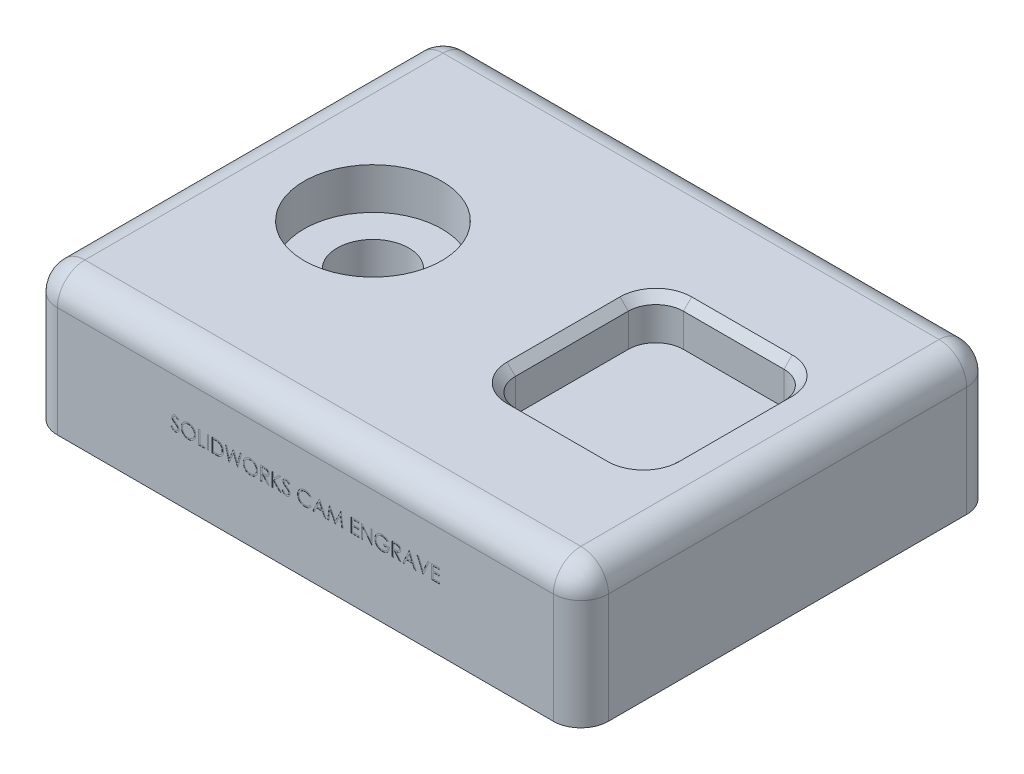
from build123d import *

# Parameters (mm, degrees)
SKETCH1_W                       = 200
SKETCH1_H                       = 150
BOSS_EXTRUDE1_DEPTH             = 50
ENGRAVE_SKETCH_W                = 0.448717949
ENGRAVE_SKETCH_H                = 5
ENGRAVE_DEPTH                   = 0.05
SKETCH4_R                       = 25
CUT_EXTRUDE3_DEPTH              = 15
CBORE_FOR_M16_SHCS1_D           = 19
CBORE_FOR_M16_SHCS1_CBORE_D     = 26
CBORE_FOR_M16_SHCS1_CBORE_DEPTH = 16
SKETCH7_W                       = 56.494229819
SKETCH7_H                       = 61.00557889
POCKET_DEPTH                    = 15
FILLET1_R                       = 10
FILLET2_R                       = 10
CHAMFER1_SIZE                   = 3


with BuildPart() as part:
    # Sketch1 → Boss-Extrude1 (new body)
    with BuildSketch(Plane(origin=(0, 0, 0), x_dir=(1, 0, 0), z_dir=(0, 1, 0))):
        Rectangle(SKETCH1_W, SKETCH1_H)
    extrude(amount=BOSS_EXTRUDE1_DEPTH)

    # Engrave_Sketch → Engrave (cut)
    # profile 1 of 20: a face of its own
    with BuildSketch(Plane.XY.offset(75)):
        with BuildLine():
            Line((-48.75, 23.464543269), (-48.327323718, 23.717948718))
            add(Edge.make_bspline(
                [(-48.327323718, 23.717948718), (-48.28801195, 23.652142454), (-48.212692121, 23.526060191), (-48.087047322, 23.355691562), (-47.956857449, 23.210888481), (-47.821158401, 23.092493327), (-47.680778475, 22.999280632), (-47.534801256, 22.933277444), (-47.383718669, 22.892111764), (-47.280898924, 22.887111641), (-47.229567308, 22.884615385)],
                knots=[0, 0, 0, 0, 1.272034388, 2.437168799, 3.508375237, 4.49857839, 5.41946034, 6.295179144, 7.148887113, 8, 8, 8, 8], degree=3))
            add(Edge.make_bspline(
                [(-47.229567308, 22.884615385), (-47.185728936, 22.885836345), (-47.09881926, 22.888256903), (-46.970873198, 22.911515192), (-46.846613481, 22.947246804), (-46.728601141, 22.998419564), (-46.618464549, 23.060331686), (-46.521883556, 23.13511194), (-46.438389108, 23.218835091), (-46.370090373, 23.312238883), (-46.317690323, 23.412691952), (-46.277415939, 23.515800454), (-46.255065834, 23.623184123), (-46.251699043, 23.695484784), (-46.25, 23.731971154)],
                knots=[0, 0, 0, 0, 1.095163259, 2.171163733, 3.241058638, 4.321873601, 5.38011039, 6.391990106, 7.366004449, 8.327778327, 9.272591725, 10.192022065, 11.087607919, 12, 12, 12, 12], degree=3))
            add(Edge.make_bspline(
                [(-46.25, 23.731971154), (-46.252106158, 23.773600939), (-46.25638767, 23.858228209), (-46.292575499, 23.983084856), (-46.349502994, 24.106645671), (-46.402021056, 24.18307605), (-46.429286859, 24.22275641)],
                knots=[0, 0, 0, 0, 0.938893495, 1.908633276, 2.914225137, 4, 4, 4, 4], degree=3))
            add(Edge.make_bspline(
                [(-46.429286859, 24.22275641), (-46.451673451, 24.25139473), (-46.4986713, 24.311517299), (-46.579467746, 24.401010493), (-46.674276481, 24.49332252), (-46.779852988, 24.591978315), (-46.900043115, 24.692389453), (-47.031082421, 24.799344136), (-47.176316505, 24.908774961), (-47.278172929, 24.98216434), (-47.330729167, 25.020032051)],
                knots=[0, 0, 0, 0, 0.722233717, 1.516239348, 2.393582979, 3.351407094, 4.387010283, 5.505090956, 6.712668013, 8, 8, 8, 8], degree=3))
            add(Edge.make_bspline(
                [(-47.330729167, 25.020032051), (-47.383334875, 25.057501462), (-47.483912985, 25.129140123), (-47.624568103, 25.235460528), (-47.750345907, 25.332666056), (-47.860687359, 25.421671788), (-47.955543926, 25.502489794), (-48.035663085, 25.574343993), (-48.09900388, 25.639177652), (-48.134226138, 25.681236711), (-48.150040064, 25.700120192)],
                knots=[0, 0, 0, 0, 1.452282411, 2.77665338, 3.964542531, 5.026858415, 5.96415736, 6.766646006, 7.446254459, 8, 8, 8, 8], degree=3))
            add(Edge.make_bspline(
                [(-48.150040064, 25.700120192), (-48.1721437, 25.729550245), (-48.215613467, 25.787428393), (-48.272993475, 25.877892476), (-48.321763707, 25.970497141), (-48.35999561, 26.065491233), (-48.392190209, 26.161541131), (-48.413844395, 26.259900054), (-48.427403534, 26.360126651), (-48.428792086, 26.427574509), (-48.429487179, 26.461338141)],
                knots=[0, 0, 0, 0, 1.068054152, 2.10047183, 3.106115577, 4.101338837, 5.06977816, 6.043150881, 7.020423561, 8, 8, 8, 8], degree=3))
            add(Edge.make_bspline(
                [(-48.429487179, 26.461338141), (-48.427622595, 26.514237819), (-48.423933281, 26.618906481), (-48.392732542, 26.771807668), (-48.343485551, 26.917788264), (-48.274492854, 27.055403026), (-48.185553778, 27.181068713), (-48.082630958, 27.296230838), (-47.96004312, 27.393043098), (-47.825539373, 27.477631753), (-47.678315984, 27.543840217), (-47.524043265, 27.593784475), (-47.362476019, 27.622083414), (-47.25304297, 27.626144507), (-47.197516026, 27.628205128)],
                knots=[0, 0, 0, 0, 1.005424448, 1.989358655, 2.955360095, 3.929531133, 4.905563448, 5.876582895, 6.856512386, 7.866279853, 8.892233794, 9.918561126, 10.94386622, 12, 12, 12, 12], degree=3))
            add(Edge.make_bspline(
                [(-47.197516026, 27.628205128), (-47.138595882, 27.626172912), (-47.021422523, 27.622131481), (-46.8490665, 27.586992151), (-46.68312262, 27.528848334), (-46.549632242, 27.462864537), (-46.445156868, 27.396962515), (-46.365481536, 27.336934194), (-46.28474232, 27.267826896), (-46.202287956, 27.189456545), (-46.119515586, 27.101104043), (-46.035196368, 27.003374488), (-45.949133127, 26.896865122), (-45.893767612, 26.820830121), (-45.865384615, 26.781850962)],
                knots=[0, 0, 0, 0, 1.286793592, 2.559021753, 3.825965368, 5.121522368, 5.803751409, 6.523245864, 7.299691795, 8.125521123, 9.008227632, 9.944561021, 10.946284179, 12, 12, 12, 12], degree=3))
            Line((-45.865384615, 26.781850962), (-46.271033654, 26.474358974))
            add(Edge.make_bspline(
                [(-46.271033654, 26.474358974), (-46.295527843, 26.505914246), (-46.342697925, 26.566682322), (-46.414311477, 26.651784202), (-46.481809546, 26.72952203), (-46.548310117, 26.797043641), (-46.610301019, 26.858046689), (-46.670468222, 26.910274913), (-46.727945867, 26.954240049), (-46.800398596, 27.001159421), (-46.891423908, 27.047668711), (-47.005687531, 27.087024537), (-47.125096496, 27.110674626), (-47.206424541, 27.113801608), (-47.247596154, 27.115384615)],
                knots=[0, 0, 0, 0, 1.181633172, 2.275549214, 3.290209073, 4.226197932, 5.078386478, 5.862611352, 6.581680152, 7.217281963, 8.414376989, 9.595101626, 10.782541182, 12, 12, 12, 12], degree=3))
            add(Edge.make_bspline(
                [(-47.247596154, 27.115384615), (-47.299248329, 27.113653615), (-47.398854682, 27.110315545), (-47.540269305, 27.073858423), (-47.667546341, 27.016455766), (-47.776907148, 26.936005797), (-47.867959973, 26.840690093), (-47.933824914, 26.731006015), (-47.973468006, 26.609888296), (-47.978305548, 26.525400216), (-47.980769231, 26.482371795)],
                knots=[0, 0, 0, 0, 1.14458467, 2.207223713, 3.21896685, 4.227309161, 5.202851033, 6.127160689, 7.046193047, 8, 8, 8, 8], degree=3))
            add(Edge.make_bspline(
                [(-47.980769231, 26.482371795), (-47.980207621, 26.455583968), (-47.979083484, 26.401964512), (-47.963405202, 26.322748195), (-47.943263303, 26.243731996), (-47.911345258, 26.165271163), (-47.867280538, 26.085993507), (-47.809416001, 26.004533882), (-47.736539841, 25.920174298), (-47.680715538, 25.865306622), (-47.651241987, 25.836338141)],
                knots=[0, 0, 0, 0, 0.858281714, 1.717966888, 2.583508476, 3.4729293, 4.427298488, 5.488583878, 6.674047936, 8, 8, 8, 8], degree=3))
            add(Edge.make_bspline(
                [(-47.651241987, 25.836338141), (-47.640297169, 25.826570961), (-47.614294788, 25.803366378), (-47.566757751, 25.765377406), (-47.503982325, 25.718516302), (-47.427607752, 25.660534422), (-47.336225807, 25.59327519), (-47.229826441, 25.517598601), (-47.109595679, 25.431047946), (-47.024278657, 25.370537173), (-46.979166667, 25.338541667)],
                knots=[0, 0, 0, 0, 0.420754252, 0.999615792, 1.744751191, 2.668019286, 3.750313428, 4.999500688, 6.413464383, 8, 8, 8, 8], degree=3))
            add(Edge.make_bspline(
                [(-46.979166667, 25.338541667), (-46.924901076, 25.29905401), (-46.819823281, 25.222591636), (-46.670312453, 25.107712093), (-46.53474987, 24.995358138), (-46.412659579, 24.886247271), (-46.302835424, 24.781207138), (-46.206495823, 24.678974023), (-46.122659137, 24.580280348), (-46.032403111, 24.453748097), (-45.940177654, 24.298346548), (-45.860975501, 24.107949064), (-45.811035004, 23.916811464), (-45.804504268, 23.788344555), (-45.801282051, 23.724959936)],
                knots=[0, 0, 0, 0, 1.163667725, 2.253281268, 3.268753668, 4.215851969, 5.092017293, 5.902905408, 6.650798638, 7.335211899, 8.59617414, 9.77448103, 10.901945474, 12, 12, 12, 12], degree=3))
            add(Edge.make_bspline(
                [(-45.801282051, 23.724959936), (-45.80222082, 23.6801337), (-45.804080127, 23.591351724), (-45.825452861, 23.460987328), (-45.856766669, 23.3343718), (-45.903962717, 23.213070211), (-45.961567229, 23.094863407), (-46.034661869, 22.982852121), (-46.119387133, 22.874557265), (-46.216578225, 22.772866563), (-46.322929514, 22.679514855), (-46.435334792, 22.596473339), (-46.55397804, 22.527232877), (-46.678215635, 22.470731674), (-46.808076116, 22.426540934), (-46.943515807, 22.39452255), (-47.084757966, 22.374871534), (-47.180758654, 22.372831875), (-47.229567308, 22.371794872)],
                knots=[0, 0, 0, 0, 0.983748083, 1.948392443, 2.894712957, 3.844097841, 4.80183111, 5.778335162, 6.776009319, 7.81870978, 8.863265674, 9.881300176, 10.883814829, 11.87499822, 12.874611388, 13.892143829, 14.928324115, 16, 16, 16, 16], degree=3))
            add(Edge.make_bspline(
                [(-47.229567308, 22.371794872), (-47.267332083, 22.372525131), (-47.342386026, 22.373976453), (-47.453399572, 22.386806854), (-47.562170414, 22.404959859), (-47.667333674, 22.433779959), (-47.770244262, 22.468747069), (-47.870454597, 22.51180183), (-47.968013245, 22.563397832), (-48.063466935, 22.622390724), (-48.156572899, 22.691044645), (-48.246457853, 22.771006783), (-48.336070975, 22.86007179), (-48.422767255, 22.960658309), (-48.508300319, 23.071141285), (-48.590983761, 23.192554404), (-48.672529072, 23.324236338), (-48.723694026, 23.416900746), (-48.75, 23.464543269)],
                knots=[0, 0, 0, 0, 0.915332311, 1.819136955, 2.706846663, 3.586547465, 4.459518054, 5.340707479, 6.227863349, 7.133153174, 8.059268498, 9.028702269, 10.047606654, 11.120612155, 12.245963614, 13.433783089, 14.680604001, 16, 16, 16, 16], degree=3))
        make_face()
    # profile 2 of 20: a face of its own
    with BuildSketch(Plane.XY.offset(75)):
        with BuildLine():
            add(Edge.make_bspline(
                [(-42.435897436, 27.628205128), (-42.343314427, 27.625860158), (-42.16147376, 27.621254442), (-41.894223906, 27.58599858), (-41.639088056, 27.525005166), (-41.393987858, 27.443772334), (-41.161855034, 27.335408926), (-40.940942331, 27.204430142), (-40.731775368, 27.049463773), (-40.537173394, 26.871707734), (-40.359092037, 26.6783028), (-40.202197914, 26.471905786), (-40.070708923, 26.25376464), (-39.962729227, 26.024534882), (-39.878016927, 25.784734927), (-39.81956115, 25.533086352), (-39.782220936, 25.271219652), (-39.777855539, 25.092609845), (-39.775641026, 25.002003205)],
                knots=[0, 0, 0, 0, 1.065120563, 2.091984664, 3.0946048, 4.079830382, 5.057816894, 6.036188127, 7.030412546, 8.04752943, 9.064399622, 10.05169764, 11.02544977, 11.989514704, 12.962713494, 13.945757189, 14.957906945, 16, 16, 16, 16], degree=3))
            add(Edge.make_bspline(
                [(-39.775641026, 25.002003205), (-39.777855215, 24.912063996), (-39.782219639, 24.734783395), (-39.819603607, 24.474578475), (-39.878233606, 24.224448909), (-39.961942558, 23.984812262), (-40.069407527, 23.755415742), (-40.201772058, 23.536862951), (-40.357688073, 23.329082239), (-40.535126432, 23.13434986), (-40.728556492, 22.955782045), (-40.936028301, 22.800183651), (-41.152875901, 22.666292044), (-41.38188977, 22.559458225), (-41.62003268, 22.474069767), (-41.869435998, 22.415851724), (-42.128931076, 22.378298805), (-42.305889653, 22.373986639), (-42.395833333, 22.371794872)],
                knots=[0, 0, 0, 0, 1.043624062, 2.057103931, 3.04512605, 4.022047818, 4.998200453, 5.980619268, 6.982898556, 8.009068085, 9.034988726, 10.034168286, 11.015286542, 11.987931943, 12.962482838, 13.94673481, 14.956375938, 16, 16, 16, 16], degree=3))
            add(Edge.make_bspline(
                [(-42.395833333, 22.371794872), (-42.486439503, 22.374008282), (-42.665048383, 22.378371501), (-42.927244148, 22.415773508), (-43.179069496, 22.474261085), (-43.419804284, 22.557845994), (-43.649582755, 22.665870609), (-43.868854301, 22.797591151), (-44.076738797, 22.953887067), (-44.271512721, 23.131267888), (-44.449725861, 23.324370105), (-44.605096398, 23.531276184), (-44.73684656, 23.747926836), (-44.844508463, 23.974923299), (-44.929743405, 24.211168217), (-44.987893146, 24.458237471), (-45.025515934, 24.714722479), (-45.029851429, 24.889355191), (-45.032051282, 24.977964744)],
                knots=[0, 0, 0, 0, 1.053102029, 2.075944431, 3.073151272, 4.055350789, 5.033113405, 6.020478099, 7.024410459, 8.052272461, 9.079885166, 10.07527673, 11.055994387, 12.023226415, 12.992069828, 13.970394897, 14.97016774, 16, 16, 16, 16], degree=3))
            add(Edge.make_bspline(
                [(-45.032051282, 24.977964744), (-45.031287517, 25.037439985), (-45.029769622, 25.155640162), (-45.011495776, 25.331163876), (-44.98497906, 25.503864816), (-44.946976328, 25.673251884), (-44.897273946, 25.838910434), (-44.838628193, 26.001982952), (-44.766999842, 26.160816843), (-44.686027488, 26.316164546), (-44.595653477, 26.465604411), (-44.495830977, 26.606860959), (-44.390066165, 26.741119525), (-44.27411846, 26.864900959), (-44.151809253, 26.981806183), (-44.021154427, 27.090038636), (-43.88295122, 27.19057428), (-43.736604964, 27.281174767), (-43.585721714, 27.363116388), (-43.43018346, 27.433433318), (-43.272102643, 27.493784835), (-43.110738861, 27.542700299), (-42.946520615, 27.581317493), (-42.779089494, 27.607613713), (-42.608578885, 27.625934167), (-42.493705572, 27.627444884), (-42.435897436, 27.628205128)],
                knots=[0, 0, 0, 0, 1.037015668, 2.060948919, 3.074880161, 4.083647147, 5.086022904, 6.090072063, 7.104153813, 8.122640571, 9.144368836, 10.147691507, 11.138137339, 12.123020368, 13.103399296, 14.087645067, 15.080126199, 16.082011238, 17.087798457, 18.072939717, 19.057185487, 20.037253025, 21.01195951, 21.997135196, 22.992090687, 24, 24, 24, 24], degree=3))
        make_face()
        with BuildLine():
            add(Edge.make_bspline(
                [(-42.413862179, 27.115384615), (-42.461311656, 27.114806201), (-42.555756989, 27.113654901), (-42.696163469, 27.098489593), (-42.834723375, 27.076875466), (-42.971465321, 27.046044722), (-43.105817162, 27.004038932), (-43.239031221, 26.955694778), (-43.369892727, 26.896807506), (-43.497969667, 26.830275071), (-43.62213406, 26.756633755), (-43.739295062, 26.675245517), (-43.849755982, 26.588019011), (-43.953246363, 26.494750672), (-44.049462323, 26.394965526), (-44.140297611, 26.290176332), (-44.222111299, 26.177387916), (-44.297090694, 26.059658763), (-44.364187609, 25.937142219), (-44.423852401, 25.81112813), (-44.472658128, 25.680588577), (-44.512461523, 25.546939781), (-44.545461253, 25.41039341), (-44.566366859, 25.269913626), (-44.581698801, 25.126206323), (-44.582784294, 25.029089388), (-44.583333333, 24.979967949)],
                knots=[0, 0, 0, 0, 1.008559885, 2.007477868, 2.99961109, 3.989939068, 4.984837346, 5.991145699, 7.001802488, 8.033829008, 9.059044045, 10.069351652, 11.065060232, 12.050310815, 13.029377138, 14.011219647, 14.996725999, 15.989392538, 16.977580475, 17.965360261, 18.951710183, 19.937753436, 20.929683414, 21.935841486, 22.955955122, 24, 24, 24, 24], degree=3))
            add(Edge.make_bspline(
                [(-44.583333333, 24.979967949), (-44.581512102, 24.907736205), (-44.577929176, 24.765634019), (-44.546561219, 24.557393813), (-44.498244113, 24.35726769), (-44.427019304, 24.166350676), (-44.337946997, 23.983001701), (-44.227908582, 23.808847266), (-44.09753846, 23.643840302), (-43.949447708, 23.489132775), (-43.787558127, 23.347924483), (-43.615654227, 23.223976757), (-43.435577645, 23.119104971), (-43.246858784, 23.033669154), (-43.050505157, 22.965969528), (-42.845251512, 22.919571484), (-42.632465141, 22.889035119), (-42.487421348, 22.886102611), (-42.413862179, 22.884615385)],
                knots=[0, 0, 0, 0, 1.032063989, 2.030389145, 3.003944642, 3.970395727, 4.937377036, 5.913328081, 6.909231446, 7.93887556, 8.970685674, 9.976071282, 10.964166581, 11.944589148, 12.933237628, 13.927779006, 14.949070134, 16, 16, 16, 16], degree=3))
            add(Edge.make_bspline(
                [(-42.413862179, 22.884615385), (-42.364420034, 22.885294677), (-42.266361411, 22.886641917), (-42.120510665, 22.900211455), (-41.977287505, 22.921971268), (-41.83689282, 22.953300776), (-41.699485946, 22.992511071), (-41.56449337, 23.03909354), (-41.433352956, 23.097209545), (-41.30441033, 23.161420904), (-41.180987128, 23.234621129), (-41.063164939, 23.313247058), (-40.953913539, 23.400345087), (-40.85050058, 23.492227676), (-40.753889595, 23.590747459), (-40.664733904, 23.695776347), (-40.583333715, 23.807977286), (-40.508382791, 23.925527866), (-40.441520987, 24.048379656), (-40.383265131, 24.174850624), (-40.333842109, 24.304629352), (-40.293944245, 24.437903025), (-40.2626793, 24.574418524), (-40.241136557, 24.714358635), (-40.226067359, 24.85744341), (-40.224931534, 24.954220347), (-40.224358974, 25.003004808)],
                knots=[0, 0, 0, 0, 1.047197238, 2.076906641, 3.100256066, 4.114471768, 5.12198147, 6.126382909, 7.136867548, 8.15857795, 9.17633901, 10.174870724, 11.156907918, 12.133735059, 13.104061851, 14.077631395, 15.04955518, 16.038496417, 17.029181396, 18.010275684, 18.986308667, 19.968651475, 20.955262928, 21.950658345, 22.966943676, 24, 24, 24, 24], degree=3))
            add(Edge.make_bspline(
                [(-40.224358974, 25.003004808), (-40.224931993, 25.051455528), (-40.226068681, 25.147566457), (-40.241129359, 25.28965334), (-40.262702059, 25.4285865), (-40.293791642, 25.563820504), (-40.33386329, 25.695389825), (-40.383273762, 25.823170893), (-40.441538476, 25.947639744), (-40.508407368, 26.068488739), (-40.58357283, 26.184452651), (-40.665707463, 26.29531324), (-40.756229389, 26.398988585), (-40.852552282, 26.498038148), (-40.957082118, 26.590349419), (-41.069345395, 26.675953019), (-41.187979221, 26.75691484), (-41.313589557, 26.829951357), (-41.443223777, 26.897400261), (-41.576243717, 26.955187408), (-41.71114243, 27.004290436), (-41.847576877, 27.046171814), (-41.986695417, 27.076754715), (-42.12755803, 27.098509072), (-42.269969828, 27.113649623), (-42.365745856, 27.114804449), (-42.413862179, 27.115384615)],
                knots=[0, 0, 0, 0, 1.02996197, 2.043119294, 3.035359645, 4.018872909, 4.991431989, 5.957985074, 6.929999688, 7.912076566, 8.892894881, 9.867085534, 10.843653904, 11.817741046, 12.803660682, 13.806313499, 14.818574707, 15.856120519, 16.894564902, 17.924820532, 18.937903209, 19.946497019, 20.957711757, 21.963978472, 22.977135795, 24, 24, 24, 24], degree=3))
        make_face(mode=Mode.SUBTRACT)
    # profile 3 of 20: a face of its own
    with BuildSketch(Plane.XY.offset(75)):
        Polygon((-38.75, 27.5), (-38.301282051, 27.5), (-38.301282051, 23.012820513), (-36.378205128, 23.012820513), (-36.378205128, 22.5), (-38.75, 22.5), align=None)
    # profile 4 of 20: a face of its own
    with BuildSketch(Plane.XY.offset(75)):
        with Locations((-35.32051282, 25)):
            Rectangle(ENGRAVE_SKETCH_W, ENGRAVE_SKETCH_H)
    # profile 5 of 20: a face of its own
    with BuildSketch(Plane.XY.offset(75)):
        with BuildLine():
            Line((-33.814102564, 22.5), (-33.814102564, 27.5))
            Line((-33.814102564, 27.5), (-32.804487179, 27.5))
            add(Edge.make_bspline(
                [(-32.804487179, 27.5), (-32.716674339, 27.499367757), (-32.547020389, 27.498146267), (-32.30185975, 27.490401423), (-32.075025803, 27.476700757), (-31.867264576, 27.456744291), (-31.678005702, 27.432239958), (-31.507779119, 27.401525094), (-31.355704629, 27.365256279), (-31.262176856, 27.334334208), (-31.217948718, 27.319711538)],
                knots=[0, 0, 0, 0, 1.314313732, 2.53924729, 3.670748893, 4.714932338, 5.66265055, 6.526160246, 7.303039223, 8, 8, 8, 8], degree=3))
            add(Edge.make_bspline(
                [(-31.217948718, 27.319711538), (-31.16009909, 27.297667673), (-31.045711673, 27.254079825), (-30.882844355, 27.171856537), (-30.729522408, 27.078694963), (-30.584923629, 26.974472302), (-30.45235102, 26.856237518), (-30.326625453, 26.72901311), (-30.212890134, 26.588172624), (-30.108735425, 26.436636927), (-30.01482734, 26.276191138), (-29.933199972, 26.107140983), (-29.865408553, 25.930344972), (-29.809132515, 25.74629476), (-29.764780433, 25.554585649), (-29.73452053, 25.354994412), (-29.714561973, 25.148309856), (-29.712556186, 25.008060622), (-29.711538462, 24.936899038)],
                knots=[0, 0, 0, 0, 0.984719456, 1.947108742, 2.898477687, 3.838006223, 4.779231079, 5.722358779, 6.681677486, 7.655904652, 8.64651281, 9.637519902, 10.640069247, 11.656948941, 12.698408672, 13.768548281, 14.867775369, 16, 16, 16, 16], degree=3))
            add(Edge.make_bspline(
                [(-29.711538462, 24.936899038), (-29.712436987, 24.875097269), (-29.714207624, 24.753310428), (-29.730106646, 24.573823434), (-29.753215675, 24.399661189), (-29.788993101, 24.231653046), (-29.832425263, 24.068327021), (-29.888088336, 23.911423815), (-29.95185333, 23.759504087), (-30.0262103, 23.614621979), (-30.10784085, 23.477360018), (-30.19544334, 23.347966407), (-30.288924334, 23.228287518), (-30.389175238, 23.11796093), (-30.494900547, 23.01715296), (-30.606792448, 22.92502151), (-30.725139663, 22.843369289), (-30.849412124, 22.768987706), (-30.983235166, 22.704101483), (-31.129143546, 22.649201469), (-31.287759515, 22.603706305), (-31.458693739, 22.565747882), (-31.642241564, 22.53563745), (-31.838582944, 22.515456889), (-32.047416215, 22.501809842), (-32.190815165, 22.500614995), (-32.264623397, 22.5)],
                knots=[0, 0, 0, 0, 1.105936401, 2.179363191, 3.223086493, 4.248585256, 5.251745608, 6.245858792, 7.225916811, 8.198733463, 9.158002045, 10.082870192, 10.993790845, 11.873723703, 12.748670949, 13.606408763, 14.465103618, 15.319838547, 16.196477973, 17.123216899, 18.106603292, 19.147568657, 20.255746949, 21.433717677, 22.679120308, 24, 24, 24, 24], degree=3))
            Line((-32.264623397, 22.5), (-33.814102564, 22.5))
        make_face()
        with BuildLine():
            Line((-33.365384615, 23.012820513), (-32.791466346, 23.012820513))
            add(Edge.make_bspline(
                [(-32.791466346, 23.012820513), (-32.708997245, 23.013174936), (-32.550378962, 23.013856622), (-32.322296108, 23.019838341), (-32.113896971, 23.029612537), (-31.925151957, 23.04329122), (-31.756167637, 23.061389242), (-31.606590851, 23.081567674), (-31.476911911, 23.10670689), (-31.398441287, 23.129493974), (-31.362179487, 23.140024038)],
                knots=[0, 0, 0, 0, 1.375205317, 2.645023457, 3.804390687, 4.853969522, 5.800190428, 6.637939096, 7.370582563, 8, 8, 8, 8], degree=3))
            add(Edge.make_bspline(
                [(-31.362179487, 23.140024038), (-31.31653897, 23.156097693), (-31.226348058, 23.187861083), (-31.096517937, 23.245800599), (-30.975436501, 23.314432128), (-30.860993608, 23.39072109), (-30.754812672, 23.477358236), (-30.655635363, 23.572459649), (-30.563661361, 23.676509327), (-30.479840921, 23.78937813), (-30.404829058, 23.910363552), (-30.339870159, 24.038276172), (-30.282939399, 24.171714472), (-30.238255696, 24.312727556), (-30.203233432, 24.460054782), (-30.178426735, 24.613706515), (-30.162977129, 24.773654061), (-30.16117506, 24.88244281), (-30.16025641, 24.937900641)],
                knots=[0, 0, 0, 0, 0.998632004, 1.973411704, 2.929992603, 3.868527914, 4.809262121, 5.754881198, 6.702106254, 7.672490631, 8.653608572, 9.636854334, 10.631411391, 11.644891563, 12.686317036, 13.754757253, 14.855430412, 16, 16, 16, 16], degree=3))
            add(Edge.make_bspline(
                [(-30.16025641, 24.937900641), (-30.160989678, 24.996377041), (-30.162430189, 25.111254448), (-30.180536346, 25.279812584), (-30.206995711, 25.441927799), (-30.24525812, 25.597610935), (-30.294016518, 25.747165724), (-30.354866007, 25.889765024), (-30.424389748, 26.026914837), (-30.507108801, 26.155449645), (-30.597702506, 26.27701123), (-30.698242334, 26.388375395), (-30.80713096, 26.489795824), (-30.923180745, 26.582851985), (-31.049662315, 26.663800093), (-31.183596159, 26.736209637), (-31.326947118, 26.797660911), (-31.426679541, 26.830345), (-31.477363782, 26.846955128)],
                knots=[0, 0, 0, 0, 1.122418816, 2.205001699, 3.251619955, 4.274784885, 5.280384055, 6.268708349, 7.249350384, 8.229342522, 9.199999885, 10.157847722, 11.105861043, 12.055065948, 13.010012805, 13.98527497, 14.976112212, 16, 16, 16, 16], degree=3))
            add(Edge.make_bspline(
                [(-31.477363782, 26.846955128), (-31.519293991, 26.858550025), (-31.60844912, 26.883203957), (-31.753934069, 26.910097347), (-31.917669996, 26.93381806), (-32.100383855, 26.953900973), (-32.301867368, 26.968311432), (-32.522275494, 26.979127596), (-32.7617035, 26.986422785), (-32.927678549, 26.986920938), (-33.013822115, 26.987179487)],
                knots=[0, 0, 0, 0, 0.674548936, 1.434276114, 2.292660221, 3.240891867, 4.284742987, 5.42552168, 6.663806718, 8, 8, 8, 8], degree=3))
            Line((-33.013822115, 26.987179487), (-33.365384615, 26.987179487))
            Line((-33.365384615, 26.987179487), (-33.365384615, 23.012820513))
        make_face(mode=Mode.SUBTRACT)
    # profile 6 of 20: a face of its own
    with BuildSketch(Plane.XY.offset(75)):
        Polygon((-29.006410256, 27.5), (-28.542668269, 27.5), (-27.564102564, 23.833133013), (-26.108774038, 27.5), (-26.043669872, 27.5), (-24.615384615, 23.858173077), (-23.631810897, 27.5), (-23.173076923, 27.5), (-24.521233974, 22.5), (-24.585336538, 22.5), (-26.08974359, 26.32411859), (-27.612179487, 22.5), (-27.676282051, 22.5), align=None)
    # profile 7 of 20: a face of its own
    with BuildSketch(Plane.XY.offset(75)):
        with BuildLine():
            add(Edge.make_bspline(
                [(-19.935897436, 27.628205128), (-19.843314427, 27.625860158), (-19.66147376, 27.621254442), (-19.394223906, 27.58599858), (-19.139088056, 27.525005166), (-18.893987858, 27.443772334), (-18.661855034, 27.335408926), (-18.440942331, 27.204430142), (-18.231775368, 27.049463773), (-18.037173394, 26.871707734), (-17.859092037, 26.6783028), (-17.702197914, 26.471905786), (-17.570708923, 26.25376464), (-17.462729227, 26.024534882), (-17.378016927, 25.784734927), (-17.31956115, 25.533086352), (-17.282220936, 25.271219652), (-17.277855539, 25.092609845), (-17.275641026, 25.002003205)],
                knots=[0, 0, 0, 0, 1.065120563, 2.091984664, 3.0946048, 4.079830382, 5.057816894, 6.036188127, 7.030412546, 8.04752943, 9.064399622, 10.05169764, 11.02544977, 11.989514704, 12.962713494, 13.945757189, 14.957906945, 16, 16, 16, 16], degree=3))
            add(Edge.make_bspline(
                [(-17.275641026, 25.002003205), (-17.277855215, 24.912063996), (-17.282219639, 24.734783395), (-17.319603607, 24.474578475), (-17.378233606, 24.224448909), (-17.461942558, 23.984812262), (-17.569407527, 23.755415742), (-17.701772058, 23.536862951), (-17.857688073, 23.329082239), (-18.035126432, 23.13434986), (-18.228556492, 22.955782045), (-18.436028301, 22.800183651), (-18.652875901, 22.666292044), (-18.88188977, 22.559458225), (-19.12003268, 22.474069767), (-19.369435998, 22.415851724), (-19.628931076, 22.378298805), (-19.805889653, 22.373986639), (-19.895833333, 22.371794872)],
                knots=[0, 0, 0, 0, 1.043624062, 2.057103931, 3.04512605, 4.022047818, 4.998200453, 5.980619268, 6.982898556, 8.009068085, 9.034988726, 10.034168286, 11.015286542, 11.987931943, 12.962482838, 13.94673481, 14.956375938, 16, 16, 16, 16], degree=3))
            add(Edge.make_bspline(
                [(-19.895833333, 22.371794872), (-19.986439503, 22.374008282), (-20.165048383, 22.378371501), (-20.427244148, 22.415773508), (-20.679069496, 22.474261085), (-20.919804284, 22.557845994), (-21.149582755, 22.665870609), (-21.368854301, 22.797591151), (-21.576738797, 22.953887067), (-21.771512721, 23.131267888), (-21.949725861, 23.324370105), (-22.105096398, 23.531276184), (-22.23684656, 23.747926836), (-22.344508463, 23.974923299), (-22.429743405, 24.211168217), (-22.487893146, 24.458237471), (-22.525515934, 24.714722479), (-22.529851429, 24.889355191), (-22.532051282, 24.977964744)],
                knots=[0, 0, 0, 0, 1.053102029, 2.075944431, 3.073151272, 4.055350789, 5.033113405, 6.020478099, 7.024410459, 8.052272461, 9.079885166, 10.07527673, 11.055994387, 12.023226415, 12.992069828, 13.970394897, 14.97016774, 16, 16, 16, 16], degree=3))
            add(Edge.make_bspline(
                [(-22.532051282, 24.977964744), (-22.531287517, 25.037439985), (-22.529769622, 25.155640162), (-22.511495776, 25.331163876), (-22.48497906, 25.503864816), (-22.446976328, 25.673251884), (-22.397273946, 25.838910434), (-22.338628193, 26.001982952), (-22.266999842, 26.160816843), (-22.186027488, 26.316164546), (-22.095653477, 26.465604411), (-21.995830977, 26.606860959), (-21.890066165, 26.741119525), (-21.77411846, 26.864900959), (-21.651809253, 26.981806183), (-21.521154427, 27.090038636), (-21.38295122, 27.19057428), (-21.236604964, 27.281174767), (-21.085721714, 27.363116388), (-20.93018346, 27.433433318), (-20.772102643, 27.493784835), (-20.610738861, 27.542700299), (-20.446520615, 27.581317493), (-20.279089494, 27.607613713), (-20.108578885, 27.625934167), (-19.993705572, 27.627444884), (-19.935897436, 27.628205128)],
                knots=[0, 0, 0, 0, 1.037015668, 2.060948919, 3.074880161, 4.083647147, 5.086022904, 6.090072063, 7.104153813, 8.122640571, 9.144368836, 10.147691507, 11.138137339, 12.123020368, 13.103399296, 14.087645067, 15.080126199, 16.082011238, 17.087798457, 18.072939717, 19.057185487, 20.037253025, 21.01195951, 21.997135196, 22.992090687, 24, 24, 24, 24], degree=3))
        make_face()
        with BuildLine():
            add(Edge.make_bspline(
                [(-19.913862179, 27.115384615), (-19.961311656, 27.114806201), (-20.055756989, 27.113654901), (-20.196163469, 27.098489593), (-20.334723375, 27.076875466), (-20.471465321, 27.046044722), (-20.605817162, 27.004038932), (-20.739031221, 26.955694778), (-20.869892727, 26.896807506), (-20.997969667, 26.830275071), (-21.12213406, 26.756633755), (-21.239295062, 26.675245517), (-21.349755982, 26.588019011), (-21.453246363, 26.494750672), (-21.549462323, 26.394965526), (-21.640297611, 26.290176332), (-21.722111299, 26.177387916), (-21.797090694, 26.059658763), (-21.864187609, 25.937142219), (-21.923852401, 25.81112813), (-21.972658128, 25.680588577), (-22.012461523, 25.546939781), (-22.045461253, 25.41039341), (-22.066366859, 25.269913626), (-22.081698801, 25.126206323), (-22.082784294, 25.029089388), (-22.083333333, 24.979967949)],
                knots=[0, 0, 0, 0, 1.008559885, 2.007477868, 2.99961109, 3.989939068, 4.984837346, 5.991145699, 7.001802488, 8.033829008, 9.059044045, 10.069351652, 11.065060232, 12.050310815, 13.029377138, 14.011219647, 14.996725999, 15.989392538, 16.977580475, 17.965360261, 18.951710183, 19.937753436, 20.929683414, 21.935841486, 22.955955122, 24, 24, 24, 24], degree=3))
            add(Edge.make_bspline(
                [(-22.083333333, 24.979967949), (-22.081512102, 24.907736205), (-22.077929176, 24.765634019), (-22.046561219, 24.557393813), (-21.998244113, 24.35726769), (-21.927019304, 24.166350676), (-21.837946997, 23.983001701), (-21.727908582, 23.808847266), (-21.59753846, 23.643840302), (-21.449447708, 23.489132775), (-21.287558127, 23.347924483), (-21.115654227, 23.223976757), (-20.935577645, 23.119104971), (-20.746858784, 23.033669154), (-20.550505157, 22.965969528), (-20.345251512, 22.919571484), (-20.132465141, 22.889035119), (-19.987421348, 22.886102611), (-19.913862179, 22.884615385)],
                knots=[0, 0, 0, 0, 1.032063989, 2.030389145, 3.003944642, 3.970395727, 4.937377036, 5.913328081, 6.909231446, 7.93887556, 8.970685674, 9.976071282, 10.964166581, 11.944589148, 12.933237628, 13.927779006, 14.949070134, 16, 16, 16, 16], degree=3))
            add(Edge.make_bspline(
                [(-19.913862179, 22.884615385), (-19.864420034, 22.885294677), (-19.766361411, 22.886641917), (-19.620510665, 22.900211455), (-19.477287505, 22.921971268), (-19.33689282, 22.953300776), (-19.199485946, 22.992511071), (-19.06449337, 23.03909354), (-18.933352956, 23.097209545), (-18.80441033, 23.161420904), (-18.680987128, 23.234621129), (-18.563164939, 23.313247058), (-18.453913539, 23.400345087), (-18.35050058, 23.492227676), (-18.253889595, 23.590747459), (-18.164733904, 23.695776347), (-18.083333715, 23.807977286), (-18.008382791, 23.925527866), (-17.941520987, 24.048379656), (-17.883265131, 24.174850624), (-17.833842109, 24.304629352), (-17.793944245, 24.437903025), (-17.7626793, 24.574418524), (-17.741136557, 24.714358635), (-17.726067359, 24.85744341), (-17.724931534, 24.954220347), (-17.724358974, 25.003004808)],
                knots=[0, 0, 0, 0, 1.047197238, 2.076906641, 3.100256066, 4.114471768, 5.12198147, 6.126382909, 7.136867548, 8.15857795, 9.17633901, 10.174870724, 11.156907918, 12.133735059, 13.104061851, 14.077631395, 15.04955518, 16.038496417, 17.029181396, 18.010275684, 18.986308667, 19.968651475, 20.955262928, 21.950658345, 22.966943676, 24, 24, 24, 24], degree=3))
            add(Edge.make_bspline(
                [(-17.724358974, 25.003004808), (-17.724931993, 25.051455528), (-17.726068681, 25.147566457), (-17.741129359, 25.28965334), (-17.762702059, 25.4285865), (-17.793791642, 25.563820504), (-17.83386329, 25.695389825), (-17.883273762, 25.823170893), (-17.941538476, 25.947639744), (-18.008407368, 26.068488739), (-18.08357283, 26.184452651), (-18.165707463, 26.29531324), (-18.256229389, 26.398988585), (-18.352552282, 26.498038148), (-18.457082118, 26.590349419), (-18.569345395, 26.675953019), (-18.687979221, 26.75691484), (-18.813589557, 26.829951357), (-18.943223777, 26.897400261), (-19.076243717, 26.955187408), (-19.21114243, 27.004290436), (-19.347576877, 27.046171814), (-19.486695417, 27.076754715), (-19.62755803, 27.098509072), (-19.769969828, 27.113649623), (-19.865745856, 27.114804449), (-19.913862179, 27.115384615)],
                knots=[0, 0, 0, 0, 1.02996197, 2.043119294, 3.035359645, 4.018872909, 4.991431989, 5.957985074, 6.929999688, 7.912076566, 8.892894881, 9.867085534, 10.843653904, 11.817741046, 12.803660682, 13.806313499, 14.818574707, 15.856120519, 16.894564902, 17.924820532, 18.937903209, 19.946497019, 20.957711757, 21.963978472, 22.977135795, 24, 24, 24, 24], degree=3))
        make_face(mode=Mode.SUBTRACT)
    # profile 8 of 20: a face of its own
    with BuildSketch(Plane.XY.offset(75)):
        with BuildLine():
            Line((-16.25, 27.5), (-15.249399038, 27.5))
            add(Edge.make_bspline(
                [(-15.249399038, 27.5), (-15.182625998, 27.499777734), (-15.054414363, 27.49935096), (-14.870738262, 27.496971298), (-14.703842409, 27.49015079), (-14.553814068, 27.484281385), (-14.420655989, 27.473578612), (-14.303959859, 27.463349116), (-14.204263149, 27.449958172), (-14.143911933, 27.437521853), (-14.116586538, 27.431891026)],
                knots=[0, 0, 0, 0, 1.410062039, 2.707475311, 3.878576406, 4.937260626, 5.877586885, 6.699081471, 7.410979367, 8, 8, 8, 8], degree=3))
            add(Edge.make_bspline(
                [(-14.116586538, 27.431891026), (-14.080005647, 27.422852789), (-14.007624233, 27.404969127), (-13.903409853, 27.367169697), (-13.804103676, 27.323427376), (-13.710118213, 27.272050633), (-13.621924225, 27.212658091), (-13.538612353, 27.146275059), (-13.459804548, 27.073264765), (-13.388687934, 26.99178642), (-13.321632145, 26.906305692), (-13.265076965, 26.813871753), (-13.216324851, 26.717212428), (-13.177509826, 26.615344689), (-13.146255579, 26.509256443), (-13.124218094, 26.397986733), (-13.111002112, 26.282042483), (-13.109656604, 26.202959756), (-13.108974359, 26.162860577)],
                knots=[0, 0, 0, 0, 1.027469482, 2.033020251, 3.019912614, 3.986113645, 4.951240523, 5.91722682, 6.890402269, 7.87763091, 8.8651537, 9.85103654, 10.82876324, 11.815024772, 12.821070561, 13.842952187, 14.906261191, 16, 16, 16, 16], degree=3))
            add(Edge.make_bspline(
                [(-13.108974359, 26.162860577), (-13.111072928, 26.096238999), (-13.115167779, 25.966243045), (-13.153346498, 25.777584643), (-13.215884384, 25.601599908), (-13.302060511, 25.438510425), (-13.411802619, 25.291495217), (-13.543695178, 25.162365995), (-13.697811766, 25.054308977), (-13.841282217, 24.979376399), (-13.968016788, 24.93138653), (-14.072350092, 24.897620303), (-14.18616006, 24.871531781), (-14.308356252, 24.848160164), (-14.439447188, 24.830514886), (-14.579118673, 24.81759118), (-14.727470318, 24.809513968), (-14.829383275, 24.808311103), (-14.881810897, 24.807692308)],
                knots=[0, 0, 0, 0, 1.260483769, 2.459530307, 3.627416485, 4.787058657, 5.939039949, 7.08810263, 8.267026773, 9.491475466, 10.141966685, 10.831826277, 11.566392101, 12.351337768, 13.187381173, 14.07005841, 15.007169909, 16, 16, 16, 16], degree=3))
            Line((-14.881810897, 24.807692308), (-13.044871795, 22.5))
            Line((-13.044871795, 22.5), (-13.599759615, 22.5))
            Line((-13.599759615, 22.5), (-15.436698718, 24.807692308))
            Line((-15.436698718, 24.807692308), (-15.801282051, 24.807692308))
            Line((-15.801282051, 24.807692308), (-15.801282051, 22.5))
            Line((-15.801282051, 22.5), (-16.25, 22.5))
            Line((-16.25, 22.5), (-16.25, 27.5))
        make_face()
        with BuildLine():
            Line((-15.801282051, 26.987179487), (-15.801282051, 25.320512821))
            Line((-15.801282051, 25.320512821), (-14.885817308, 25.313501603))
            add(Edge.make_bspline(
                [(-14.885817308, 25.313501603), (-14.843074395, 25.313482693), (-14.760226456, 25.313446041), (-14.640368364, 25.319151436), (-14.528768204, 25.32564189), (-14.425852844, 25.335569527), (-14.331576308, 25.348363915), (-14.245985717, 25.364368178), (-14.168941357, 25.383013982), (-14.079086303, 25.411873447), (-13.978748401, 25.457596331), (-13.869703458, 25.524118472), (-13.776842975, 25.607788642), (-13.698388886, 25.703465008), (-13.635346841, 25.808659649), (-13.59090105, 25.922111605), (-13.562697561, 26.040956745), (-13.559371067, 26.122639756), (-13.557692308, 26.163862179)],
                knots=[0, 0, 0, 0, 1.146690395, 2.22261258, 3.21895312, 4.145990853, 4.996080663, 5.770904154, 6.481378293, 7.121626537, 8.300444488, 9.431385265, 10.535395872, 11.636531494, 12.74115979, 13.810798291, 14.895190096, 16, 16, 16, 16], degree=3))
            add(Edge.make_bspline(
                [(-13.557692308, 26.163862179), (-13.559409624, 26.204071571), (-13.562812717, 26.283751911), (-13.590596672, 26.400403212), (-13.637581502, 26.510498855), (-13.700898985, 26.613590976), (-13.778040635, 26.707170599), (-13.868494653, 26.787237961), (-13.969787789, 26.853308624), (-14.06446093, 26.895529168), (-14.149081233, 26.921414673), (-14.222552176, 26.939630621), (-14.305568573, 26.954265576), (-14.398533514, 26.965991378), (-14.501050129, 26.97606987), (-14.613636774, 26.982858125), (-14.73554646, 26.986877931), (-14.820042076, 26.987076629), (-14.863782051, 26.987179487)],
                knots=[0, 0, 0, 0, 1.101028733, 2.181837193, 3.264309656, 4.369019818, 5.486613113, 6.575447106, 7.666700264, 8.788928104, 9.402425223, 10.0903467, 10.862060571, 11.710948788, 12.657782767, 13.684531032, 14.801375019, 16, 16, 16, 16], degree=3))
            Line((-14.863782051, 26.987179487), (-15.801282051, 26.987179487))
        make_face(mode=Mode.SUBTRACT)
    # profile 9 of 20: a face of its own
    with BuildSketch(Plane.XY.offset(75)):
        Polygon((-12.019230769, 27.5), (-11.570512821, 27.5), (-11.570512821, 25.595953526), (-9.486177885, 27.5), (-8.846153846, 27.5), (-11.303084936, 25.256410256), (-8.653846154, 22.5), (-9.251802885, 22.5), (-11.570512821, 24.912860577), (-11.570512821, 22.5), (-12.019230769, 22.5), align=None)
    # profile 10 of 20: a face of its own
    with BuildSketch(Plane.XY.offset(75)):
        with BuildLine():
            Line((-8.429487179, 23.464543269), (-8.006810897, 23.717948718))
            add(Edge.make_bspline(
                [(-8.006810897, 23.717948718), (-7.96749913, 23.652142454), (-7.8921793, 23.526060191), (-7.766534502, 23.355691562), (-7.636344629, 23.210888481), (-7.500645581, 23.092493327), (-7.360265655, 22.999280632), (-7.214288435, 22.933277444), (-7.063205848, 22.892111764), (-6.960386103, 22.887111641), (-6.909054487, 22.884615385)],
                knots=[0, 0, 0, 0, 1.272034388, 2.437168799, 3.508375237, 4.49857839, 5.41946034, 6.295179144, 7.148887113, 8, 8, 8, 8], degree=3))
            add(Edge.make_bspline(
                [(-6.909054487, 22.884615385), (-6.865216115, 22.885836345), (-6.778306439, 22.888256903), (-6.650360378, 22.911515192), (-6.52610066, 22.947246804), (-6.408088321, 22.998419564), (-6.297951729, 23.060331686), (-6.201370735, 23.13511194), (-6.117876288, 23.218835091), (-6.049577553, 23.312238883), (-5.997177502, 23.412691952), (-5.956903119, 23.515800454), (-5.934553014, 23.623184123), (-5.931186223, 23.695484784), (-5.929487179, 23.731971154)],
                knots=[0, 0, 0, 0, 1.095163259, 2.171163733, 3.241058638, 4.321873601, 5.38011039, 6.391990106, 7.366004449, 8.327778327, 9.272591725, 10.192022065, 11.087607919, 12, 12, 12, 12], degree=3))
            add(Edge.make_bspline(
                [(-5.929487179, 23.731971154), (-5.931593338, 23.773600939), (-5.935874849, 23.858228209), (-5.972062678, 23.983084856), (-6.028990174, 24.106645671), (-6.081508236, 24.18307605), (-6.108774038, 24.22275641)],
                knots=[0, 0, 0, 0, 0.938893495, 1.908633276, 2.914225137, 4, 4, 4, 4], degree=3))
            add(Edge.make_bspline(
                [(-6.108774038, 24.22275641), (-6.13116063, 24.25139473), (-6.178158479, 24.311517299), (-6.258954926, 24.401010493), (-6.35376366, 24.49332252), (-6.459340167, 24.591978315), (-6.579530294, 24.692389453), (-6.710569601, 24.799344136), (-6.855803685, 24.908774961), (-6.957660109, 24.98216434), (-7.010216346, 25.020032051)],
                knots=[0, 0, 0, 0, 0.722233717, 1.516239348, 2.393582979, 3.351407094, 4.387010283, 5.505090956, 6.712668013, 8, 8, 8, 8], degree=3))
            add(Edge.make_bspline(
                [(-7.010216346, 25.020032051), (-7.062822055, 25.057501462), (-7.163400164, 25.129140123), (-7.304055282, 25.235460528), (-7.429833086, 25.332666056), (-7.540174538, 25.421671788), (-7.635031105, 25.502489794), (-7.715150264, 25.574343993), (-7.77849106, 25.639177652), (-7.813713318, 25.681236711), (-7.829527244, 25.700120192)],
                knots=[0, 0, 0, 0, 1.452282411, 2.77665338, 3.964542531, 5.026858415, 5.96415736, 6.766646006, 7.446254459, 8, 8, 8, 8], degree=3))
            add(Edge.make_bspline(
                [(-7.829527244, 25.700120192), (-7.85163088, 25.729550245), (-7.895100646, 25.787428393), (-7.952480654, 25.877892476), (-8.001250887, 25.970497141), (-8.03948279, 26.065491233), (-8.071677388, 26.161541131), (-8.093331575, 26.259900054), (-8.106890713, 26.360126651), (-8.108279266, 26.427574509), (-8.108974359, 26.461338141)],
                knots=[0, 0, 0, 0, 1.068054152, 2.10047183, 3.106115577, 4.101338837, 5.06977816, 6.043150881, 7.020423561, 8, 8, 8, 8], degree=3))
            add(Edge.make_bspline(
                [(-8.108974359, 26.461338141), (-8.107109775, 26.514237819), (-8.10342046, 26.618906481), (-8.072219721, 26.771807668), (-8.02297273, 26.917788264), (-7.953980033, 27.055403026), (-7.865040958, 27.181068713), (-7.762118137, 27.296230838), (-7.6395303, 27.393043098), (-7.505026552, 27.477631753), (-7.357803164, 27.543840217), (-7.203530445, 27.593784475), (-7.041963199, 27.622083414), (-6.932530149, 27.626144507), (-6.877003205, 27.628205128)],
                knots=[0, 0, 0, 0, 1.005424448, 1.989358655, 2.955360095, 3.929531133, 4.905563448, 5.876582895, 6.856512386, 7.866279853, 8.892233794, 9.918561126, 10.94386622, 12, 12, 12, 12], degree=3))
            add(Edge.make_bspline(
                [(-6.877003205, 27.628205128), (-6.818083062, 27.626172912), (-6.700909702, 27.622131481), (-6.52855368, 27.586992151), (-6.362609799, 27.528848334), (-6.229119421, 27.462864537), (-6.124644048, 27.396962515), (-6.044968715, 27.336934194), (-5.9642295, 27.267826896), (-5.881775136, 27.189456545), (-5.799002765, 27.101104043), (-5.714683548, 27.003374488), (-5.628620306, 26.896865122), (-5.573254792, 26.820830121), (-5.544871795, 26.781850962)],
                knots=[0, 0, 0, 0, 1.286793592, 2.559021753, 3.825965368, 5.121522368, 5.803751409, 6.523245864, 7.299691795, 8.125521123, 9.008227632, 9.944561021, 10.946284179, 12, 12, 12, 12], degree=3))
            Line((-5.544871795, 26.781850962), (-5.950520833, 26.474358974))
            add(Edge.make_bspline(
                [(-5.950520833, 26.474358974), (-5.975015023, 26.505914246), (-6.022185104, 26.566682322), (-6.093798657, 26.651784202), (-6.161296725, 26.72952203), (-6.227797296, 26.797043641), (-6.289788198, 26.858046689), (-6.349955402, 26.910274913), (-6.407433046, 26.954240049), (-6.479885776, 27.001159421), (-6.570911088, 27.047668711), (-6.685174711, 27.087024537), (-6.804583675, 27.110674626), (-6.88591172, 27.113801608), (-6.927083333, 27.115384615)],
                knots=[0, 0, 0, 0, 1.181633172, 2.275549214, 3.290209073, 4.226197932, 5.078386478, 5.862611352, 6.581680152, 7.217281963, 8.414376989, 9.595101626, 10.782541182, 12, 12, 12, 12], degree=3))
            add(Edge.make_bspline(
                [(-6.927083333, 27.115384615), (-6.978735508, 27.113653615), (-7.078341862, 27.110315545), (-7.219756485, 27.073858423), (-7.34703352, 27.016455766), (-7.456394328, 26.936005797), (-7.547447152, 26.840690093), (-7.613312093, 26.731006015), (-7.652955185, 26.609888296), (-7.657792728, 26.525400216), (-7.66025641, 26.482371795)],
                knots=[0, 0, 0, 0, 1.14458467, 2.207223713, 3.21896685, 4.227309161, 5.202851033, 6.127160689, 7.046193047, 8, 8, 8, 8], degree=3))
            add(Edge.make_bspline(
                [(-7.66025641, 26.482371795), (-7.659694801, 26.455583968), (-7.658570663, 26.401964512), (-7.642892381, 26.322748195), (-7.622750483, 26.243731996), (-7.590832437, 26.165271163), (-7.546767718, 26.085993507), (-7.488903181, 26.004533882), (-7.416027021, 25.920174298), (-7.360202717, 25.865306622), (-7.330729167, 25.836338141)],
                knots=[0, 0, 0, 0, 0.858281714, 1.717966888, 2.583508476, 3.4729293, 4.427298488, 5.488583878, 6.674047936, 8, 8, 8, 8], degree=3))
            add(Edge.make_bspline(
                [(-7.330729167, 25.836338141), (-7.319784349, 25.826570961), (-7.293781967, 25.803366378), (-7.246244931, 25.765377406), (-7.183469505, 25.718516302), (-7.107094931, 25.660534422), (-7.015712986, 25.59327519), (-6.90931362, 25.517598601), (-6.789082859, 25.431047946), (-6.703765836, 25.370537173), (-6.658653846, 25.338541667)],
                knots=[0, 0, 0, 0, 0.420754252, 0.999615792, 1.744751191, 2.668019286, 3.750313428, 4.999500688, 6.413464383, 8, 8, 8, 8], degree=3))
            add(Edge.make_bspline(
                [(-6.658653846, 25.338541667), (-6.604388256, 25.29905401), (-6.499310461, 25.222591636), (-6.349799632, 25.107712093), (-6.214237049, 24.995358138), (-6.092146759, 24.886247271), (-5.982322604, 24.781207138), (-5.885983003, 24.678974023), (-5.802146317, 24.580280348), (-5.71189029, 24.453748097), (-5.619664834, 24.298346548), (-5.54046268, 24.107949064), (-5.490522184, 23.916811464), (-5.483991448, 23.788344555), (-5.480769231, 23.724959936)],
                knots=[0, 0, 0, 0, 1.163667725, 2.253281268, 3.268753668, 4.215851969, 5.092017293, 5.902905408, 6.650798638, 7.335211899, 8.59617414, 9.77448103, 10.901945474, 12, 12, 12, 12], degree=3))
            add(Edge.make_bspline(
                [(-5.480769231, 23.724959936), (-5.481708, 23.6801337), (-5.483567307, 23.591351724), (-5.504940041, 23.460987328), (-5.536253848, 23.3343718), (-5.583449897, 23.213070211), (-5.641054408, 23.094863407), (-5.714149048, 22.982852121), (-5.798874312, 22.874557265), (-5.896065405, 22.772866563), (-6.002416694, 22.679514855), (-6.114821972, 22.596473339), (-6.233465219, 22.527232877), (-6.357702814, 22.470731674), (-6.487563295, 22.426540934), (-6.623002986, 22.39452255), (-6.764245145, 22.374871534), (-6.860245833, 22.372831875), (-6.909054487, 22.371794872)],
                knots=[0, 0, 0, 0, 0.983748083, 1.948392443, 2.894712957, 3.844097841, 4.80183111, 5.778335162, 6.776009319, 7.81870978, 8.863265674, 9.881300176, 10.883814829, 11.87499822, 12.874611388, 13.892143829, 14.928324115, 16, 16, 16, 16], degree=3))
            add(Edge.make_bspline(
                [(-6.909054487, 22.371794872), (-6.946819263, 22.372525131), (-7.021873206, 22.373976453), (-7.132886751, 22.386806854), (-7.241657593, 22.404959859), (-7.346820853, 22.433779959), (-7.449731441, 22.468747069), (-7.549941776, 22.51180183), (-7.647500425, 22.563397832), (-7.742954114, 22.622390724), (-7.836060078, 22.691044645), (-7.925945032, 22.771006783), (-8.015558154, 22.86007179), (-8.102254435, 22.960658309), (-8.187787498, 23.071141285), (-8.27047094, 23.192554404), (-8.352016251, 23.324236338), (-8.403181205, 23.416900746), (-8.429487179, 23.464543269)],
                knots=[0, 0, 0, 0, 0.915332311, 1.819136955, 2.706846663, 3.586547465, 4.459518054, 5.340707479, 6.227863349, 7.133153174, 8.059268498, 9.028702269, 10.047606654, 11.120612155, 12.245963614, 13.433783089, 14.680604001, 16, 16, 16, 16], degree=3))
        make_face()
    # profile 11 of 20: a face of its own
    with BuildSketch(Plane.XY.offset(75)):
        with BuildLine():
            Line((2.083333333, 26.582532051), (1.690705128, 26.282051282))
            add(Edge.make_bspline(
                [(1.690705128, 26.282051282), (1.662696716, 26.315431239), (1.607057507, 26.381741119), (1.51754436, 26.474854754), (1.424256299, 26.562090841), (1.327228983, 26.643864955), (1.224715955, 26.717317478), (1.119200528, 26.786276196), (1.008917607, 26.84808725), (0.856415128, 26.923034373), (0.656918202, 27.001243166), (0.405782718, 27.066819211), (0.143624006, 27.108563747), (-0.035229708, 27.11308495), (-0.126201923, 27.115384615)],
                knots=[0, 0, 0, 0, 0.757959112, 1.505699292, 2.245454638, 2.979532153, 3.711538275, 4.438200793, 5.171680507, 5.909471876, 7.393775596, 8.890124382, 10.418191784, 12, 12, 12, 12], degree=3))
            add(Edge.make_bspline(
                [(-0.126201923, 27.115384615), (-0.176320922, 27.114807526), (-0.276093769, 27.113658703), (-0.424163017, 27.09850281), (-0.569467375, 27.077201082), (-0.711912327, 27.045593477), (-0.851316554, 27.005632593), (-0.988591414, 26.957882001), (-1.121749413, 26.898803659), (-1.252632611, 26.833506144), (-1.378031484, 26.759752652), (-1.496681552, 26.679305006), (-1.608150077, 26.59306344), (-1.712525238, 26.500704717), (-1.809913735, 26.402644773), (-1.899609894, 26.297838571), (-1.981303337, 26.18662118), (-2.056613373, 26.070459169), (-2.124060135, 25.949690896), (-2.180531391, 25.823869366), (-2.230538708, 25.695149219), (-2.270109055, 25.562076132), (-2.301429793, 25.425586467), (-2.323040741, 25.285313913), (-2.338024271, 25.141551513), (-2.339167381, 25.044109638), (-2.33974359, 24.994991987)],
                knots=[0, 0, 0, 0, 1.054917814, 2.100044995, 3.131103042, 4.146048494, 5.169673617, 6.183595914, 7.203665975, 8.234915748, 9.262203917, 10.264457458, 11.251630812, 12.227803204, 13.197192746, 14.159520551, 15.12972552, 16.100847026, 17.073214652, 18.039054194, 19.002613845, 19.979014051, 20.95965708, 21.949030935, 22.966165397, 24, 24, 24, 24], degree=3))
            add(Edge.make_bspline(
                [(-2.33974359, 24.994991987), (-2.337940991, 24.921090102), (-2.334401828, 24.775993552), (-2.302904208, 24.563464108), (-2.255039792, 24.359863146), (-2.183303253, 24.166463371), (-2.094847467, 23.980880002), (-1.983075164, 23.806253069), (-1.853622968, 23.639943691), (-1.704659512, 23.485882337), (-1.541222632, 23.345148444), (-1.365868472, 23.221219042), (-1.179033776, 23.117912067), (-0.982781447, 23.031946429), (-0.775601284, 22.965865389), (-0.557865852, 22.919345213), (-0.330048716, 22.888999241), (-0.174378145, 22.886093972), (-0.095152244, 22.884615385)],
                knots=[0, 0, 0, 0, 1.029171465, 2.020641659, 2.987623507, 3.938342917, 4.889210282, 5.84687017, 6.821220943, 7.821438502, 8.827599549, 9.822697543, 10.807740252, 11.797342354, 12.80366471, 13.83203677, 14.896651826, 16, 16, 16, 16], degree=3))
            add(Edge.make_bspline(
                [(-0.095152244, 22.884615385), (-0.007862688, 22.887027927), (0.163944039, 22.891776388), (0.415898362, 22.932003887), (0.657092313, 22.997229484), (0.887538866, 23.08851223), (1.10658836, 23.207176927), (1.314583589, 23.351031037), (1.511700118, 23.521442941), (1.630230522, 23.651561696), (1.690705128, 23.717948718)],
                knots=[0, 0, 0, 0, 1.028121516, 2.023589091, 2.998037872, 3.967518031, 4.937445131, 5.927275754, 6.942489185, 8, 8, 8, 8], degree=3))
            Line((1.690705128, 23.717948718), (2.083333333, 23.420472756))
            add(Edge.make_bspline(
                [(2.083333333, 23.420472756), (2.051736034, 23.379703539), (1.988692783, 23.298360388), (1.886609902, 23.183686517), (1.779070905, 23.075823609), (1.665277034, 22.975641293), (1.546537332, 22.881134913), (1.420719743, 22.79498944), (1.289478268, 22.716002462), (1.153257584, 22.643678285), (1.012202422, 22.579510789), (0.866481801, 22.524576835), (0.716723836, 22.477255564), (0.562921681, 22.438324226), (0.404756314, 22.407936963), (0.242798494, 22.387623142), (0.076698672, 22.373706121), (-0.035360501, 22.37243767), (-0.092147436, 22.371794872)],
                knots=[0, 0, 0, 0, 0.986787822, 1.968848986, 2.935600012, 3.899624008, 4.868462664, 5.837806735, 6.815139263, 7.798259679, 8.787526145, 9.778297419, 10.776456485, 11.791383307, 12.812564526, 13.85620153, 14.913611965, 16, 16, 16, 16], degree=3))
            add(Edge.make_bspline(
                [(-0.092147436, 22.371794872), (-0.145924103, 22.372169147), (-0.252260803, 22.372909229), (-0.40925902, 22.38489804), (-0.562101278, 22.401254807), (-0.710350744, 22.425883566), (-0.854816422, 22.454946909), (-0.994188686, 22.493905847), (-1.129838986, 22.537547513), (-1.26122233, 22.588840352), (-1.388450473, 22.646720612), (-1.51111306, 22.712137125), (-1.629153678, 22.784539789), (-1.743732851, 22.862332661), (-1.85315797, 22.948014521), (-1.958377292, 23.040395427), (-2.05998083, 23.139164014), (-2.122841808, 23.210385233), (-2.154447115, 23.24619391)],
                knots=[0, 0, 0, 0, 1.114604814, 2.203992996, 3.262667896, 4.300477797, 5.318619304, 6.316056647, 7.298880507, 8.271930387, 9.238335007, 10.195173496, 11.151986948, 12.108099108, 13.064862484, 14.031167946, 15.010108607, 16, 16, 16, 16], degree=3))
            add(Edge.make_bspline(
                [(-2.154447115, 23.24619391), (-2.205069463, 23.308395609), (-2.305703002, 23.432048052), (-2.434453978, 23.632456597), (-2.544664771, 23.841696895), (-2.633773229, 24.060868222), (-2.703434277, 24.289478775), (-2.751693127, 24.527643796), (-2.783052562, 24.775140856), (-2.786638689, 24.943479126), (-2.788461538, 25.029046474)],
                knots=[0, 0, 0, 0, 0.994628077, 1.977248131, 2.950237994, 3.925870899, 4.908910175, 5.911660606, 6.938484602, 8, 8, 8, 8], degree=3))
            add(Edge.make_bspline(
                [(-2.788461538, 25.029046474), (-2.786239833, 25.118982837), (-2.781868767, 25.295927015), (-2.744731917, 25.555604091), (-2.684990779, 25.804391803), (-2.600138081, 26.041825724), (-2.492559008, 26.269154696), (-2.359663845, 26.484642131), (-2.202996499, 26.689666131), (-2.023785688, 26.881115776), (-1.827260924, 27.056171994), (-1.616805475, 27.210180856), (-1.392831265, 27.338348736), (-1.157805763, 27.445486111), (-0.909969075, 27.527835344), (-0.649849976, 27.585482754), (-0.377937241, 27.621364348), (-0.19241949, 27.62590036), (-0.098157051, 27.628205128)],
                knots=[0, 0, 0, 0, 1.032925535, 2.032216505, 3.007276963, 3.968222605, 4.92396291, 5.891752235, 6.871517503, 7.883894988, 8.900124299, 9.891468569, 10.874487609, 11.85992873, 12.854644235, 13.869047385, 14.917252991, 16, 16, 16, 16], degree=3))
            add(Edge.make_bspline(
                [(-0.098157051, 27.628205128), (-0.040707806, 27.627516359), (0.07300719, 27.626153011), (0.241225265, 27.612858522), (0.405000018, 27.590696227), (0.564444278, 27.560530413), (0.72033373, 27.523091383), (0.871476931, 27.474319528), (1.01876077, 27.418553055), (1.161256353, 27.354326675), (1.298279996, 27.28223133), (1.429789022, 27.203066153), (1.55473882, 27.116929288), (1.674008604, 27.024553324), (1.785603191, 26.923983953), (1.892691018, 26.817987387), (1.991635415, 26.703510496), (2.052711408, 26.622932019), (2.083333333, 26.582532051)],
                knots=[0, 0, 0, 0, 1.096760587, 2.17092713, 3.219439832, 4.250915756, 5.268269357, 6.278326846, 7.281116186, 8.274029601, 9.260640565, 10.235837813, 11.203064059, 12.156899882, 13.114053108, 14.069676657, 15.032185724, 16, 16, 16, 16], degree=3))
        make_face()
    # profile 12 of 20: a face of its own
    with BuildSketch(Plane.XY.offset(75)):
        Polygon((5.16025641, 27.5), (7.467948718, 22.5), (6.980168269, 22.5), (6.240985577, 24.102564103), (3.974358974, 24.102564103), (3.214142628, 22.5), (2.724358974, 22.5), (5.096153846, 27.5), align=None)
        Polygon((5.123197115, 26.525440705), (4.217748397, 24.615384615), (6.004607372, 24.615384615), align=None, mode=Mode.SUBTRACT)
    # profile 13 of 20: a face of its own
    with BuildSketch(Plane.XY.offset(75)):
        Polygon((8.108974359, 22.5), (8.769030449, 27.5), (8.833133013, 27.5), (10.897435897, 23.397435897), (12.956730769, 27.5), (13.021834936, 27.5), (13.685897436, 22.5), (13.235176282, 22.5), (12.756410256, 26.09775641), (10.951522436, 22.5), (10.850360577, 22.5), (9.038461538, 26.105769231), (8.560697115, 22.5), align=None)
    # profile 14 of 20: a face of its own
    with BuildSketch(Plane.XY.offset(75)):
        Polygon((16.634615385, 27.5), (19.455128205, 27.5), (19.455128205, 26.987179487), (17.083333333, 26.987179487), (17.083333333, 25.448717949), (19.455128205, 25.448717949), (19.455128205, 24.935897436), (17.083333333, 24.935897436), (17.083333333, 23.012820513), (19.455128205, 23.012820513), (19.455128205, 22.5), (16.634615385, 22.5), align=None)
    # profile 15 of 20: a face of its own
    with BuildSketch(Plane.XY.offset(75)):
        Polygon((20.352564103, 22.5), (20.352564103, 27.5), (20.446714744, 27.5), (23.75, 23.564703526), (23.75, 27.5), (24.198717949, 27.5), (24.198717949, 22.5), (24.096554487, 22.5), (20.801282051, 26.426282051), (20.801282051, 22.5), align=None)
    # profile 16 of 20: a face of its own
    with BuildSketch(Plane.XY.offset(75)):
        with BuildLine():
            Line((30.16025641, 26.646634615), (29.775641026, 26.282051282))
            add(Edge.make_bspline(
                [(29.775641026, 26.282051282), (29.706042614, 26.347523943), (29.568505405, 26.476908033), (29.344276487, 26.644780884), (29.110328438, 26.788589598), (28.867882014, 26.905598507), (28.622941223, 26.998959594), (28.378757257, 27.065428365), (28.137834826, 27.107817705), (27.977595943, 27.112886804), (27.898637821, 27.115384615)],
                knots=[0, 0, 0, 0, 1.08915593, 2.152340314, 3.188132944, 4.216796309, 5.218260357, 6.173443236, 7.099959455, 8, 8, 8, 8], degree=3))
            add(Edge.make_bspline(
                [(27.898637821, 27.115384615), (27.850188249, 27.11479375), (27.753414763, 27.113613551), (27.609669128, 27.098550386), (27.467431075, 27.076886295), (27.326969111, 27.045540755), (27.188010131, 27.005813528), (27.051037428, 26.956120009), (26.915795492, 26.898183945), (26.783558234, 26.831237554), (26.655357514, 26.757694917), (26.534276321, 26.676197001), (26.419542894, 26.589355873), (26.313313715, 26.494997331), (26.214977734, 26.393976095), (26.122194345, 26.288171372), (26.03822678, 26.174692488), (25.962382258, 26.055627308), (25.894722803, 25.933067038), (25.834996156, 25.808191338), (25.784857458, 25.681414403), (25.745186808, 25.55257715), (25.712457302, 25.422676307), (25.689432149, 25.29081242), (25.676451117, 25.156844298), (25.674205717, 25.067133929), (25.673076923, 25.022035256)],
                knots=[0, 0, 0, 0, 1.02818874, 2.053710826, 3.065248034, 4.081641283, 5.106893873, 6.131558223, 7.173050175, 8.228653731, 9.27666206, 10.308777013, 11.325269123, 12.329503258, 13.32196095, 14.316845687, 15.314881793, 16.315733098, 17.311955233, 18.285320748, 19.252783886, 20.203351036, 21.145449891, 22.095197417, 23.042428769, 24, 24, 24, 24], degree=3))
            add(Edge.make_bspline(
                [(25.673076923, 25.022035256), (25.674156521, 24.975934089), (25.676312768, 24.883857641), (25.690113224, 24.746437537), (25.715724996, 24.611058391), (25.74996458, 24.477275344), (25.792794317, 24.344859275), (25.84618384, 24.214384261), (25.909420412, 24.085855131), (25.982615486, 23.960429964), (26.062881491, 23.838254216), (26.152800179, 23.723169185), (26.248315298, 23.61364236), (26.352906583, 23.512105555), (26.463220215, 23.415842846), (26.582552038, 23.327506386), (26.708555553, 23.245394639), (26.841422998, 23.170542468), (26.979712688, 23.103673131), (27.121508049, 23.044210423), (27.267262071, 22.995239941), (27.416208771, 22.955328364), (27.568170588, 22.922613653), (27.723918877, 22.901567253), (27.882308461, 22.886294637), (27.989077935, 22.885177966), (28.04286859, 22.884615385)],
                knots=[0, 0, 0, 0, 0.93586088, 1.869166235, 2.799637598, 3.729985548, 4.670839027, 5.622275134, 6.589130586, 7.576015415, 8.568469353, 9.55398029, 10.53834874, 11.515998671, 12.510579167, 13.508179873, 14.527009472, 15.561807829, 16.601455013, 17.643573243, 18.680854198, 19.719860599, 20.772568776, 21.833555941, 22.908541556, 24, 24, 24, 24], degree=3))
            add(Edge.make_bspline(
                [(28.04286859, 22.884615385), (28.1076948, 22.885970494), (28.234991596, 22.88863147), (28.422115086, 22.909346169), (28.601833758, 22.941698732), (28.77364262, 22.989078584), (28.937741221, 23.049512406), (29.094731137, 23.122362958), (29.243376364, 23.210424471), (29.384123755, 23.309815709), (29.513776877, 23.420551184), (29.63071134, 23.540043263), (29.733062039, 23.66771193), (29.822354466, 23.802805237), (29.896223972, 23.946441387), (29.956856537, 24.097916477), (30.003332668, 24.257298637), (30.022411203, 24.367429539), (30.032051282, 24.423076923)],
                knots=[0, 0, 0, 0, 1.13008108, 2.219097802, 3.278683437, 4.311054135, 5.322181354, 6.324827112, 7.324222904, 8.330512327, 9.32562643, 10.293043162, 11.24128371, 12.174520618, 13.111833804, 14.052305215, 15.015860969, 16, 16, 16, 16], degree=3))
            Line((30.032051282, 24.423076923), (28.365384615, 24.423076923))
            Line((28.365384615, 24.423076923), (28.365384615, 24.935897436))
            Line((28.365384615, 24.935897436), (30.480769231, 24.935897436))
            add(Edge.make_bspline(
                [(30.480769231, 24.935897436), (30.478332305, 24.840315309), (30.4735628, 24.653243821), (30.440107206, 24.380429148), (30.386083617, 24.122755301), (30.312283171, 23.879950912), (30.216747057, 23.652360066), (30.100500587, 23.439751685), (29.961683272, 23.243499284), (29.805239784, 23.062000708), (29.629668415, 22.900101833), (29.439713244, 22.757807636), (29.235060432, 22.637946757), (29.015903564, 22.540431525), (28.782960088, 22.464325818), (28.535690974, 22.410366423), (28.274431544, 22.378037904), (28.095379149, 22.373907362), (28.00380609, 22.371794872)],
                knots=[0, 0, 0, 0, 1.140356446, 2.231883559, 3.274166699, 4.278491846, 5.25512956, 6.21435461, 7.1637429, 8.11826594, 9.068280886, 10.0076534, 10.945064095, 11.891975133, 12.864533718, 13.863980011, 14.907571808, 16, 16, 16, 16], degree=3))
            add(Edge.make_bspline(
                [(28.00380609, 22.371794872), (27.947363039, 22.372607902), (27.836039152, 22.37421146), (27.671623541, 22.385607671), (27.511741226, 22.403151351), (27.356415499, 22.429644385), (27.20507501, 22.46209389), (27.058475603, 22.503646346), (26.916058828, 22.551744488), (26.777604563, 22.606452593), (26.644369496, 22.669840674), (26.515760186, 22.740283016), (26.391065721, 22.817416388), (26.271135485, 22.902574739), (26.155344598, 22.995121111), (26.044439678, 23.095240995), (25.937799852, 23.202628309), (25.87099919, 23.278884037), (25.837339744, 23.317307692)],
                knots=[0, 0, 0, 0, 1.107784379, 2.184907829, 3.233506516, 4.263428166, 5.276301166, 6.270063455, 7.25232949, 8.225834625, 9.190232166, 10.146266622, 11.1027726, 12.066435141, 13.031522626, 14.010570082, 14.99756817, 16, 16, 16, 16], degree=3))
            add(Edge.make_bspline(
                [(25.837339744, 23.317307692), (25.788502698, 23.378265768), (25.691639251, 23.499170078), (25.56695617, 23.692884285), (25.460668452, 23.893458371), (25.374428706, 24.101450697), (25.307088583, 24.316666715), (25.258793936, 24.538831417), (25.230497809, 24.768230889), (25.226421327, 24.923466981), (25.224358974, 25.002003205)],
                knots=[0, 0, 0, 0, 1.023165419, 2.029347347, 3.013907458, 3.994755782, 4.975994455, 5.96558838, 6.970761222, 8, 8, 8, 8], degree=3))
            add(Edge.make_bspline(
                [(25.224358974, 25.002003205), (25.225119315, 25.060812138), (25.226630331, 25.177682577), (25.244952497, 25.351193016), (25.271240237, 25.521622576), (25.309878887, 25.688831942), (25.358587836, 25.852932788), (25.419378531, 26.014001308), (25.490156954, 26.172132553), (25.572421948, 26.326238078), (25.663971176, 26.474272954), (25.763328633, 26.615641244), (25.871905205, 26.74776848), (25.987927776, 26.872327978), (26.112780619, 26.987754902), (26.245294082, 27.095117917), (26.385570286, 27.19456104), (26.534050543, 27.284517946), (26.688518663, 27.365323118), (26.84860438, 27.43616485), (27.014258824, 27.494712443), (27.184240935, 27.544389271), (27.359837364, 27.581125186), (27.539773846, 27.607766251), (27.724988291, 27.625995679), (27.850182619, 27.627461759), (27.913661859, 27.628205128)],
                knots=[0, 0, 0, 0, 1.008945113, 2.00506715, 2.99143336, 3.967273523, 4.948097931, 5.927297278, 6.919902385, 7.919676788, 8.923139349, 9.905703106, 10.883022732, 11.856032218, 12.825136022, 13.798837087, 14.781400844, 15.773989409, 16.776158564, 17.77167057, 18.775803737, 19.789618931, 20.80898985, 21.851988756, 22.910860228, 24, 24, 24, 24], degree=3))
            add(Edge.make_bspline(
                [(27.913661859, 27.628205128), (27.965430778, 27.627377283), (28.068082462, 27.625735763), (28.220833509, 27.614357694), (28.371223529, 27.596323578), (28.519475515, 27.571713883), (28.66508461, 27.538194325), (28.808465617, 27.49808249), (28.949826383, 27.451379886), (29.088723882, 27.395681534), (29.226092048, 27.33246207), (29.362694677, 27.261300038), (29.498065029, 27.180978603), (29.632437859, 27.091259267), (29.766660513, 26.993682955), (29.898610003, 26.885458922), (30.031471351, 26.770854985), (30.116902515, 26.688451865), (30.16025641, 26.646634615)],
                knots=[0, 0, 0, 0, 0.985871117, 1.954866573, 2.915460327, 3.869826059, 4.81536089, 5.759505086, 6.70452669, 7.649098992, 8.607881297, 9.583363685, 10.581137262, 11.603961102, 12.659522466, 13.73993555, 14.853081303, 16, 16, 16, 16], degree=3))
        make_face()
    # profile 17 of 20: a face of its own
    with BuildSketch(Plane.XY.offset(75)):
        with BuildLine():
            Line((31.506410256, 27.5), (32.507011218, 27.5))
            add(Edge.make_bspline(
                [(32.507011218, 27.5), (32.573784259, 27.499777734), (32.701995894, 27.49935096), (32.885671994, 27.496971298), (33.052567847, 27.49015079), (33.202596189, 27.484281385), (33.335754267, 27.473578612), (33.452450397, 27.463349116), (33.552147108, 27.449958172), (33.612498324, 27.437521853), (33.639823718, 27.431891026)],
                knots=[0, 0, 0, 0, 1.410062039, 2.707475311, 3.878576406, 4.937260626, 5.877586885, 6.699081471, 7.410979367, 8, 8, 8, 8], degree=3))
            add(Edge.make_bspline(
                [(33.639823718, 27.431891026), (33.67640461, 27.422852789), (33.748786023, 27.404969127), (33.853000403, 27.367169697), (33.95230658, 27.323427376), (34.046292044, 27.272050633), (34.134486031, 27.212658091), (34.217797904, 27.146275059), (34.296605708, 27.073264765), (34.367722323, 26.99178642), (34.434778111, 26.906305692), (34.491333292, 26.813871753), (34.540085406, 26.717212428), (34.57890043, 26.615344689), (34.610154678, 26.509256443), (34.632192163, 26.397986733), (34.645408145, 26.282042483), (34.646753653, 26.202959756), (34.647435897, 26.162860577)],
                knots=[0, 0, 0, 0, 1.027469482, 2.033020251, 3.019912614, 3.986113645, 4.951240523, 5.91722682, 6.890402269, 7.87763091, 8.8651537, 9.85103654, 10.82876324, 11.815024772, 12.821070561, 13.842952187, 14.906261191, 16, 16, 16, 16], degree=3))
            add(Edge.make_bspline(
                [(34.647435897, 26.162860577), (34.645337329, 26.096238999), (34.641242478, 25.966243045), (34.603063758, 25.777584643), (34.540525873, 25.601599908), (34.454349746, 25.438510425), (34.344607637, 25.291495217), (34.212715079, 25.162365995), (34.058598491, 25.054308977), (33.915128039, 24.979376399), (33.788393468, 24.93138653), (33.684060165, 24.897620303), (33.570250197, 24.871531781), (33.448054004, 24.848160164), (33.316963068, 24.830514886), (33.177291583, 24.81759118), (33.028939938, 24.809513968), (32.927026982, 24.808311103), (32.874599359, 24.807692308)],
                knots=[0, 0, 0, 0, 1.260483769, 2.459530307, 3.627416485, 4.787058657, 5.939039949, 7.08810263, 8.267026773, 9.491475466, 10.141966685, 10.831826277, 11.566392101, 12.351337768, 13.187381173, 14.07005841, 15.007169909, 16, 16, 16, 16], degree=3))
            Line((32.874599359, 24.807692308), (34.711538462, 22.5))
            Line((34.711538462, 22.5), (34.156650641, 22.5))
            Line((34.156650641, 22.5), (32.319711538, 24.807692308))
            Line((32.319711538, 24.807692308), (31.955128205, 24.807692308))
            Line((31.955128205, 24.807692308), (31.955128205, 22.5))
            Line((31.955128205, 22.5), (31.506410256, 22.5))
            Line((31.506410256, 22.5), (31.506410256, 27.5))
        make_face()
        with BuildLine():
            Line((31.955128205, 26.987179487), (31.955128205, 25.320512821))
            Line((31.955128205, 25.320512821), (32.870592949, 25.313501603))
            add(Edge.make_bspline(
                [(32.870592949, 25.313501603), (32.913335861, 25.313482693), (32.9961838, 25.313446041), (33.116041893, 25.319151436), (33.227642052, 25.32564189), (33.330557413, 25.335569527), (33.424833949, 25.348363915), (33.510424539, 25.364368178), (33.587468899, 25.383013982), (33.677323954, 25.411873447), (33.777661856, 25.457596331), (33.886706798, 25.524118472), (33.979567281, 25.607788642), (34.05802137, 25.703465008), (34.121063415, 25.808659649), (34.165509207, 25.922111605), (34.193712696, 26.040956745), (34.197039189, 26.122639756), (34.198717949, 26.163862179)],
                knots=[0, 0, 0, 0, 1.146690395, 2.22261258, 3.21895312, 4.145990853, 4.996080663, 5.770904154, 6.481378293, 7.121626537, 8.300444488, 9.431385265, 10.535395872, 11.636531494, 12.74115979, 13.810798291, 14.895190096, 16, 16, 16, 16], degree=3))
            add(Edge.make_bspline(
                [(34.198717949, 26.163862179), (34.197000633, 26.204071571), (34.19359754, 26.283751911), (34.165813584, 26.400403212), (34.118828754, 26.510498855), (34.055511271, 26.613590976), (33.978369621, 26.707170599), (33.887915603, 26.787237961), (33.786622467, 26.853308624), (33.691949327, 26.895529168), (33.607329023, 26.921414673), (33.53385808, 26.939630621), (33.450841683, 26.954265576), (33.357876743, 26.965991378), (33.255360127, 26.97606987), (33.142773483, 26.982858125), (33.020863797, 26.986877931), (32.936368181, 26.987076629), (32.892628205, 26.987179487)],
                knots=[0, 0, 0, 0, 1.101028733, 2.181837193, 3.264309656, 4.369019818, 5.486613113, 6.575447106, 7.666700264, 8.788928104, 9.402425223, 10.0903467, 10.862060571, 11.710948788, 12.657782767, 13.684531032, 14.801375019, 16, 16, 16, 16], degree=3))
            Line((32.892628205, 26.987179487), (31.955128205, 26.987179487))
        make_face(mode=Mode.SUBTRACT)
    # profile 18 of 20: a face of its own
    with BuildSketch(Plane.XY.offset(75)):
        Polygon((37.788461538, 27.5), (40.096153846, 22.5), (39.608373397, 22.5), (38.869190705, 24.102564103), (36.602564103, 24.102564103), (35.842347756, 22.5), (35.352564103, 22.5), (37.724358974, 27.5), align=None)
        Polygon((37.751402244, 26.525440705), (36.845953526, 24.615384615), (38.6328125, 24.615384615), align=None, mode=Mode.SUBTRACT)
    # profile 19 of 20: a face of its own
    with BuildSketch(Plane.XY.offset(75)):
        Polygon((40.608974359, 27.5), (41.08974359, 27.5), (42.756410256, 23.559695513), (44.423076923, 27.5), (44.903846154, 27.5), (42.788461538, 22.5), (42.724358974, 22.5), align=None)
    # profile 20 of 20: a face of its own
    with BuildSketch(Plane.XY.offset(75)):
        Polygon((45.801282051, 27.5), (48.621794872, 27.5), (48.621794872, 26.987179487), (46.25, 26.987179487), (46.25, 25.448717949), (48.621794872, 25.448717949), (48.621794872, 24.935897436), (46.25, 24.935897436), (46.25, 23.012820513), (48.621794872, 23.012820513), (48.621794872, 22.5), (45.801282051, 22.5), align=None)
    extrude(amount=-ENGRAVE_DEPTH, mode=Mode.SUBTRACT)

    # Sketch4 → Cut-Extrude3 (cut)
    with BuildSketch(Plane(origin=(0, 50, 0), x_dir=(1, 0, 0), z_dir=(0, 1, 0))):
        with Locations(Location((-50, -0.46083141, 0), (0, 0, 270))):
            Circle(SKETCH4_R)
    extrude(amount=-CUT_EXTRUDE3_DEPTH, mode=Mode.SUBTRACT)

    # CBORE for M16 SHCS1 (through all)
    with Locations(Plane(origin=(0, 35, 0), x_dir=(1, 0, 0), z_dir=(0, 1, 0))):
        with Locations((-50, -0.46083141)):
            CounterBoreHole(CBORE_FOR_M16_SHCS1_D / 2, CBORE_FOR_M16_SHCS1_CBORE_D / 2, CBORE_FOR_M16_SHCS1_CBORE_DEPTH)

    # Sketch7 → Pocket (cut)
    with BuildSketch(Plane(origin=(0, 50, 0), x_dir=(1, 0, 0), z_dir=(0, 1, 0))):
        with Locations((49.945719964, 0)):
            Rectangle(SKETCH7_W, SKETCH7_H)
    extrude(amount=-POCKET_DEPTH, mode=Mode.SUBTRACT)

    # Fillet1
    fillet1_edges = [part.edges().sort_by_distance(p)[0] for p in [
        (78.192834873, 42.5, -30.502789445),
        (78.192834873, 42.5, 30.502789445),
        (21.698605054, 42.5, 30.502789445),
        (21.698605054, 42.5, -30.502789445),
        (100, 25, 75),
        (-100, 25, 75),
        (-100, 25, -75),
        (100, 25, -75),
    ]]
    fillet(fillet1_edges, radius=FILLET1_R)

    # Fillet2
    fillet2_edges = [part.edges().sort_by_distance(p)[0] for p in [
        (-100, 50, 0),
        (0, 50, -75),
        (100, 50, 0),
        (0, 50, 75),
        (97.071067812, 50, -72.071067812),
        (97.071067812, 50, 72.071067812),
        (-97.071067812, 50, 72.071067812),
        (-97.071067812, 50, -72.071067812),
    ]]
    fillet(fillet2_edges, radius=FILLET2_R)

    # Chamfer1
    chamfer1_edges = [part.edges().sort_by_distance(p)[0] for p in [
        (49.945719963, 50, -30.502789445),
        (78.192834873, 50, 0),
        (49.945719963, 50, 30.502789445),
        (21.698605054, 50, 0),
        (75.263902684, 50, 27.573857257),
        (75.263902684, 50, -27.573857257),
        (24.627537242, 50, -27.573857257),
        (24.627537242, 50, 27.573857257),
    ]]
    chamfer(chamfer1_edges, length=CHAMFER1_SIZE)


solid = part.part
